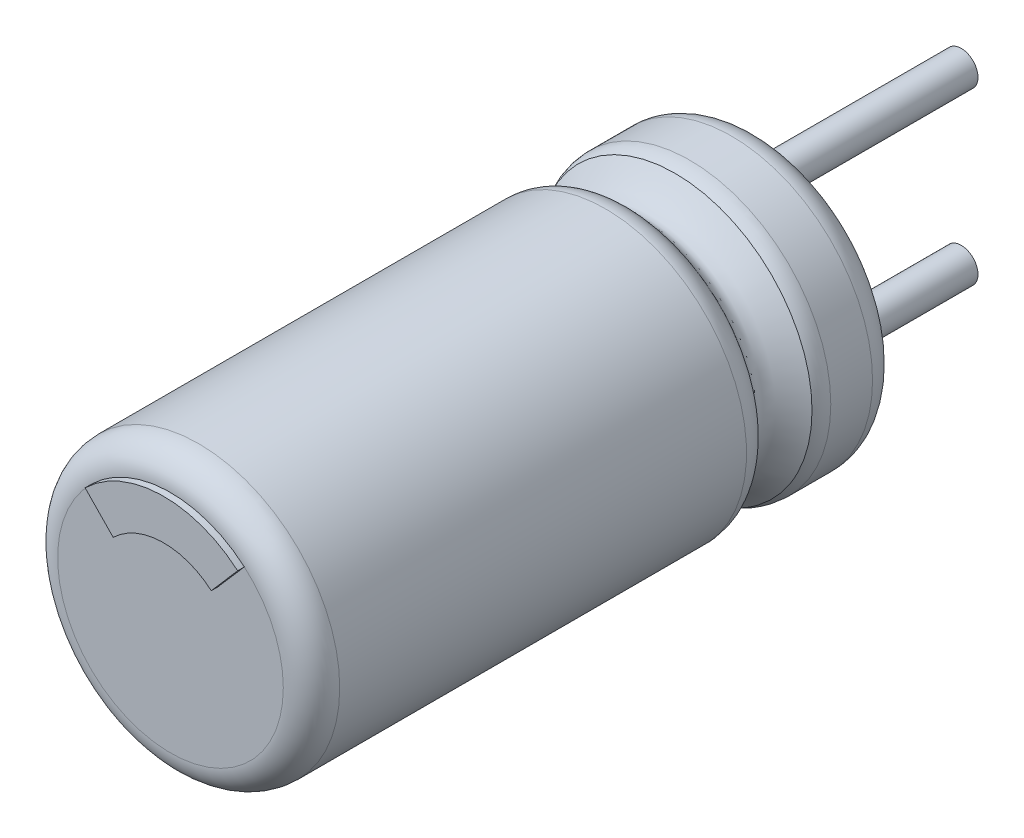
ISO-10303-21;
HEADER;
FILE_DESCRIPTION(('STEP AP214'),'2;1');
FILE_NAME('part.step','',(''),(''),'','','');
FILE_SCHEMA(('AUTOMOTIVE_DESIGN { 1 0 10303 214 1 1 1 1 }'));
ENDSEC;
DATA;
#1=APPLICATION_CONTEXT('core data for automotive mechanical design processes');
#2=APPLICATION_PROTOCOL_DEFINITION('international standard','automotive_design',2000,#1);
#3=PRODUCT_CONTEXT('',#1,'mechanical');
#4=PRODUCT('Part','Part','',(#3));
#5=PRODUCT_RELATED_PRODUCT_CATEGORY('part','',(#4));
#6=PRODUCT_DEFINITION_FORMATION('','',#4);
#7=PRODUCT_DEFINITION_CONTEXT('part definition',#1,'design');
#8=PRODUCT_DEFINITION('design','',#6,#7);
#9=PRODUCT_DEFINITION_SHAPE('','',#8);
#10=(LENGTH_UNIT() NAMED_UNIT(*) SI_UNIT(.MILLI.,.METRE.));
#11=(NAMED_UNIT(*) PLANE_ANGLE_UNIT() SI_UNIT($,.RADIAN.));
#12=(NAMED_UNIT(*) SI_UNIT($,.STERADIAN.) SOLID_ANGLE_UNIT());
#13=UNCERTAINTY_MEASURE_WITH_UNIT(LENGTH_MEASURE(1.E-05),#10,'distance_accuracy_value','');
#14=(GEOMETRIC_REPRESENTATION_CONTEXT(3) GLOBAL_UNCERTAINTY_ASSIGNED_CONTEXT((#13)) GLOBAL_UNIT_ASSIGNED_CONTEXT((#10,
#11,#12)) REPRESENTATION_CONTEXT('',''));
#15=CARTESIAN_POINT('',(0.,0.,0.));
#16=DIRECTION('',(0.,0.,1.));
#17=DIRECTION('',(1.,0.,0.));
#18=AXIS2_PLACEMENT_3D('',#15,#16,#17);
#19=CARTESIAN_POINT('',(0.,0.,0.));
#20=DIRECTION('',(0.,0.,1.));
#21=DIRECTION('',(1.,0.,0.));
#22=AXIS2_PLACEMENT_3D('',#19,#20,#21);
#23=PLANE('',#22);
#24=CARTESIAN_POINT('',(0.,1.27,0.));
#25=DIRECTION('',(0.,0.,1.));
#26=DIRECTION('',(1.,0.,0.));
#27=AXIS2_PLACEMENT_3D('',#24,#25,#26);
#28=CIRCLE('',#27,0.25);
#29=CARTESIAN_POINT('',(0.25,1.27,0.));
#30=VERTEX_POINT('',#29);
#31=EDGE_CURVE('E33',#30,#30,#28,.F.);
#32=ORIENTED_EDGE('',*,*,#31,.F.);
#33=EDGE_LOOP('',(#32));
#34=FACE_BOUND('',#33,.T.);
#35=CARTESIAN_POINT('',(0.,0.,0.));
#36=DIRECTION('',(0.,0.,1.));
#37=DIRECTION('',(1.,0.,0.));
#38=AXIS2_PLACEMENT_3D('',#35,#36,#37);
#39=CIRCLE('',#38,1.68);
#40=CARTESIAN_POINT('',(1.68,0.,0.));
#41=VERTEX_POINT('',#40);
#42=EDGE_CURVE('E106',#41,#41,#39,.F.);
#43=ORIENTED_EDGE('',*,*,#42,.T.);
#44=EDGE_LOOP('',(#43));
#45=FACE_BOUND('',#44,.T.);
#46=CARTESIAN_POINT('',(0.,-1.27,0.));
#47=DIRECTION('',(0.,0.,-1.));
#48=DIRECTION('',(-1.,0.,0.));
#49=AXIS2_PLACEMENT_3D('',#46,#47,#48);
#50=CIRCLE('',#49,0.25);
#51=CARTESIAN_POINT('',(-0.25,-1.27,0.));
#52=VERTEX_POINT('',#51);
#53=EDGE_CURVE('E11',#52,#52,#50,.T.);
#54=ORIENTED_EDGE('',*,*,#53,.F.);
#55=EDGE_LOOP('',(#54));
#56=FACE_BOUND('',#55,.T.);
#57=ADVANCED_FACE('F29',(#34,#45,#56),#23,.F.);
#58=CARTESIAN_POINT('',(0.,0.,1.26));
#59=DIRECTION('',(0.,0.,-1.));
#60=DIRECTION('',(-1.,0.,0.));
#61=AXIS2_PLACEMENT_3D('',#58,#59,#60);
#62=CYLINDRICAL_SURFACE('',#61,2.1);
#63=CARTESIAN_POINT('',(0.,0.,0.420000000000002));
#64=DIRECTION('',(0.,0.,1.));
#65=DIRECTION('',(1.,0.,0.));
#66=AXIS2_PLACEMENT_3D('',#63,#64,#65);
#67=CIRCLE('',#66,2.1);
#68=CARTESIAN_POINT('',(2.1,0.,0.420000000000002));
#69=VERTEX_POINT('',#68);
#70=EDGE_CURVE('E100',#69,#69,#67,.T.);
#71=ORIENTED_EDGE('',*,*,#70,.T.);
#72=EDGE_LOOP('',(#71));
#73=FACE_BOUND('',#72,.T.);
#74=CARTESIAN_POINT('',(0.,0.,1.04172901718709));
#75=DIRECTION('',(0.,0.,1.));
#76=DIRECTION('',(1.,0.,0.));
#77=AXIS2_PLACEMENT_3D('',#74,#75,#76);
#78=CIRCLE('',#77,2.1);
#79=CARTESIAN_POINT('',(2.1,0.,1.04172901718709));
#80=VERTEX_POINT('',#79);
#81=EDGE_CURVE('E98',#80,#80,#78,.F.);
#82=ORIENTED_EDGE('',*,*,#81,.T.);
#83=EDGE_LOOP('',(#82));
#84=FACE_BOUND('',#83,.T.);
#85=ADVANCED_FACE('F31',(#73,#84),#62,.T.);
#86=CARTESIAN_POINT('',(-1.50899360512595,1.4604582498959,1.21387283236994));
#87=CARTESIAN_POINT('',(-1.35553127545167,1.34036125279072,1.3595947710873));
#88=CARTESIAN_POINT('',(-1.01454808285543,1.07351363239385,1.68337932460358));
#89=CARTESIAN_POINT('',(-1.52634017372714,1.07033370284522,1.92241639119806));
#90=CARTESIAN_POINT('',(-1.80779596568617,1.068584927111,2.05387283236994));
#91=CARTESIAN_POINT('',(-4.42991010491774,-1.55752896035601,1.21387283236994));
#92=CARTESIAN_POINT('',(-4.03625378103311,-1.37070129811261,1.3595947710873));
#93=CARTESIAN_POINT('',(-3.16157534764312,-0.95558253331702,1.68337932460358));
#94=CARTESIAN_POINT('',(-3.66700757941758,-1.98234664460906,1.92241639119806));
#95=CARTESIAN_POINT('',(-3.94496581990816,-2.54700700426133,2.05387283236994));
#96=CARTESIAN_POINT('',(-1.41192289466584,-4.4784454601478,1.21387283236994));
#97=CARTESIAN_POINT('',(-1.32519123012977,-4.05142380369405,1.3595947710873));
#98=CARTESIAN_POINT('',(-1.13247918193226,-3.10260979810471,1.68337932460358));
#99=CARTESIAN_POINT('',(-0.614327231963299,-4.1230140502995,1.92241639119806));
#100=CARTESIAN_POINT('',(-0.32937388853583,-4.68417685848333,2.05387283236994));
#101=CARTESIAN_POINT('',(1.50899360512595,-1.4604582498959,1.21387283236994));
#102=CARTESIAN_POINT('',(1.35553127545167,-1.34036125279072,1.3595947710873));
#103=CARTESIAN_POINT('',(1.01454808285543,-1.07351363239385,1.68337932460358));
#104=CARTESIAN_POINT('',(1.52634017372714,-1.07033370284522,1.92241639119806));
#105=CARTESIAN_POINT('',(1.80779596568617,-1.068584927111,2.05387283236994));
#106=CARTESIAN_POINT('',(4.42991010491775,1.55752896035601,1.21387283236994));
#107=CARTESIAN_POINT('',(4.03625378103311,1.37070129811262,1.3595947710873));
#108=CARTESIAN_POINT('',(3.16157534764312,0.955582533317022,1.68337932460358));
#109=CARTESIAN_POINT('',(3.66700757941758,1.98234664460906,1.92241639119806));
#110=CARTESIAN_POINT('',(3.94496581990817,2.54700700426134,2.05387283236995));
#111=CARTESIAN_POINT('',(1.41192289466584,4.4784454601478,1.21387283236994));
#112=CARTESIAN_POINT('',(1.32519123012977,4.05142380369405,1.3595947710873));
#113=CARTESIAN_POINT('',(1.13247918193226,3.10260979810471,1.68337932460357));
#114=CARTESIAN_POINT('',(0.614327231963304,4.1230140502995,1.92241639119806));
#115=CARTESIAN_POINT('',(0.329373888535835,4.68417685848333,2.05387283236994));
#116=CARTESIAN_POINT('',(-1.50899360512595,1.4604582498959,1.21387283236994));
#117=CARTESIAN_POINT('',(-1.35553127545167,1.34036125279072,1.3595947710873));
#118=CARTESIAN_POINT('',(-1.01454808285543,1.07351363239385,1.68337932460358));
#119=CARTESIAN_POINT('',(-1.52634017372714,1.07033370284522,1.92241639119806));
#120=CARTESIAN_POINT('',(-1.80779596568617,1.068584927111,2.05387283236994));
#121=(BOUNDED_SURFACE() B_SPLINE_SURFACE(3,3,((#86,#87,#88,#89,#90),(#91,#92,#93,#94,#95),(#96,
#97,#98,#99,#100),(#101,#102,#103,#104,#105),(#106,#107,#108,#109,#110),(#111,#112,#113,#114,
#115),(#116,#117,#118,#119,#120)),.UNSPECIFIED.,.T.,.F.,.F.) B_SPLINE_SURFACE_WITH_KNOTS((4,3,
4),(4,1,4),(0.,0.5,1.),(0.,0.45005834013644,1.),
.UNSPECIFIED.) GEOMETRIC_REPRESENTATION_ITEM() RATIONAL_B_SPLINE_SURFACE(((1.,1.,1.,1.,1.),
(0.333333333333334,0.333333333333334,0.333333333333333,0.333333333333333,0.333333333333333),
(0.333333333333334,0.333333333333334,0.333333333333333,0.333333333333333,0.333333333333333),(1.,
1.,1.,1.,1.),(0.333333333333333,0.333333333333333,0.333333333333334,0.333333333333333,
0.333333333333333),(0.333333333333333,0.333333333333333,0.333333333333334,0.333333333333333,
0.333333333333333),(1.,1.,1.,1.,1.))) REPRESENTATION_ITEM('') SURFACE());
#122=CARTESIAN_POINT('',(0.,0.,1.94152539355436));
#123=DIRECTION('',(0.,0.,1.));
#124=DIRECTION('',(1.,0.,0.));
#125=AXIS2_PLACEMENT_3D('',#122,#123,#124);
#126=CIRCLE('',#125,1.90462380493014);
#127=CARTESIAN_POINT('',(-1.57437307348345,1.07188677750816,1.94152539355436));
#128=VERTEX_POINT('',#127);
#129=EDGE_CURVE('E74',#128,#128,#126,.F.);
#130=CARTESIAN_POINT('',(0.,0.,1.26));
#131=DIRECTION('',(0.,0.,1.));
#132=DIRECTION('',(1.,0.,0.));
#133=AXIS2_PLACEMENT_3D('',#130,#131,#132);
#134=CIRCLE('',#133,2.0388283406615);
#135=CARTESIAN_POINT('',(-1.4605981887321,1.42248864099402,1.26));
#136=VERTEX_POINT('',#135);
#137=EDGE_CURVE('E91',#136,#136,#134,.T.);
#138=CARTESIAN_POINT('',(-1.57437307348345,1.07188677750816,1.94152539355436));
#139=CARTESIAN_POINT('',(-1.57289940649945,1.07193285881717,1.94077078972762));
#140=CARTESIAN_POINT('',(-1.5714263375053,1.07197971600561,1.9400150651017));
#141=CARTESIAN_POINT('',(-1.56848497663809,1.07207491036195,1.93850313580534));
#142=CARTESIAN_POINT('',(-1.56701668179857,1.07212324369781,1.93774693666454));
#143=CARTESIAN_POINT('',(-1.56408496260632,1.07222141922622,1.9362340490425));
#144=CARTESIAN_POINT('',(-1.56262153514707,1.07227125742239,1.93547736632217));
#145=CARTESIAN_POINT('',(-1.55969964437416,1.07237247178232,1.93396350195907));
#146=CARTESIAN_POINT('',(-1.55824117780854,1.07242384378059,1.93320632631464));
#147=CARTESIAN_POINT('',(-1.5553293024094,1.07252815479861,1.93169146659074));
#148=CARTESIAN_POINT('',(-1.5538758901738,1.07258108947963,1.93093378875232));
#149=CARTESIAN_POINT('',(-1.55097421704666,1.07268855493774,1.92941791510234));
#150=CARTESIAN_POINT('',(-1.54952595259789,1.07274308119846,1.92865972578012));
#151=CARTESIAN_POINT('',(-1.54663466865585,1.07285375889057,1.92714281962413));
#152=CARTESIAN_POINT('',(-1.5451916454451,1.07290990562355,1.92638410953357));
#153=CARTESIAN_POINT('',(-1.5423109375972,1.07302385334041,1.92486615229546));
#154=CARTESIAN_POINT('',(-1.54087324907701,1.07308164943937,1.92410691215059));
#155=CARTESIAN_POINT('',(-1.53800330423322,1.07319892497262,1.92258788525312));
#156=CARTESIAN_POINT('',(-1.53657104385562,1.07325839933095,1.92182810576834));
#157=CARTESIAN_POINT('',(-1.53371204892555,1.07337906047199,1.92030799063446));
#158=CARTESIAN_POINT('',(-1.53228531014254,1.07344024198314,1.91954766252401));
#159=CARTESIAN_POINT('',(-1.52943745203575,1.0735643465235,1.9180264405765));
#160=CARTESIAN_POINT('',(-1.52801632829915,1.07362726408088,1.91726555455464));
#161=CARTESIAN_POINT('',(-1.52517979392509,1.07375486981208,1.91574320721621));
#162=CARTESIAN_POINT('',(-1.5237643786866,1.07381955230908,1.91498175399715));
#163=CARTESIAN_POINT('',(-1.5209393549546,1.07395071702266,1.91345826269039));
#164=CARTESIAN_POINT('',(-1.51952974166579,1.07401719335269,1.91269623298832));
#165=CARTESIAN_POINT('',(-1.51671641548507,1.07415197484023,1.91117157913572));
#166=CARTESIAN_POINT('',(-1.51531269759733,1.07422027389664,1.91040896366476));
#167=CARTESIAN_POINT('',(-1.51251125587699,1.07435872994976,1.90888312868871));
#168=CARTESIAN_POINT('',(-1.51111352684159,1.07442888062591,1.90811991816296));
#169=CARTESIAN_POINT('',(-1.50832415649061,1.07457106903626,1.90659288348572));
#170=CARTESIAN_POINT('',(-1.50693250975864,1.07464310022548,1.90582906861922));
#171=CARTESIAN_POINT('',(-1.50415539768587,1.07478907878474,1.90430081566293));
#172=CARTESIAN_POINT('',(-1.50276992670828,1.07486301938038,1.90353638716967));
#173=CARTESIAN_POINT('',(-1.50000525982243,1.07501284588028,1.90200689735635));
#174=CARTESIAN_POINT('',(-1.49862605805,1.07508872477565,1.90124184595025));
#175=CARTESIAN_POINT('',(-1.49587402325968,1.07524245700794,1.89971110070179));
#176=CARTESIAN_POINT('',(-1.494501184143,1.07532030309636,1.89894541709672));
#177=CARTESIAN_POINT('',(-1.49176196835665,1.07547799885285,1.89741339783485));
#178=CARTESIAN_POINT('',(-1.49039558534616,1.07555784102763,1.89664707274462));
#179=CARTESIAN_POINT('',(-1.48766937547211,1.07571955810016,1.89511376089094));
#180=CARTESIAN_POINT('',(-1.48630954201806,1.07580142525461,1.89434678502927));
#181=CARTESIAN_POINT('',(-1.48359652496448,1.0759672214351,1.89281216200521));
#182=CARTESIAN_POINT('',(-1.48224333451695,1.07605114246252,1.89204452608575));
#183=CARTESIAN_POINT('',(-1.47954369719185,1.0762210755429,1.89050857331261));
#184=CARTESIAN_POINT('',(-1.47819724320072,1.07630707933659,1.88974026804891));
#185=CARTESIAN_POINT('',(-1.47551117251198,1.07648120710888,1.8882029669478));
#186=CARTESIAN_POINT('',(-1.47417154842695,1.07656932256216,1.88743398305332));
#187=CARTESIAN_POINT('',(-1.4714992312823,1.07674770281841,1.88589531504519));
#188=CARTESIAN_POINT('',(-1.47016653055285,1.07683795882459,1.88512564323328));
#189=CARTESIAN_POINT('',(-1.46750815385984,1.07702064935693,1.8835855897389));
#190=CARTESIAN_POINT('',(-1.46618246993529,1.07711307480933,1.88281522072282));
#191=CARTESIAN_POINT('',(-1.46353822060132,1.07730013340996,1.88127376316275));
#192=CARTESIAN_POINT('',(-1.46221964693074,1.07739475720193,1.88050268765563));
#193=CARTESIAN_POINT('',(-1.45958971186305,1.07758624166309,1.87895980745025));
#194=CARTESIAN_POINT('',(-1.45827834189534,1.07768309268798,1.8781880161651));
#195=CARTESIAN_POINT('',(-1.45566290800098,1.07787906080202,1.87664369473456));
#196=CARTESIAN_POINT('',(-1.4543588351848,1.07797816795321,1.87587117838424));
#197=CARTESIAN_POINT('',(-1.45175808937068,1.07817867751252,1.87432539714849));
#198=CARTESIAN_POINT('',(-1.45046140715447,1.07828006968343,1.87355214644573));
#199=CARTESIAN_POINT('',(-1.4478755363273,1.07848517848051,1.8720048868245));
#200=CARTESIAN_POINT('',(-1.44658633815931,1.07858888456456,1.87123089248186));
#201=CARTESIAN_POINT('',(-1.44401552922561,1.07879865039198,1.86968213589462));
#202=CARTESIAN_POINT('',(-1.44273390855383,1.07890469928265,1.8689073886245));
#203=CARTESIAN_POINT('',(-1.44017834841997,1.07911917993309,1.86735711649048));
#204=CARTESIAN_POINT('',(-1.43890439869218,1.07922760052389,1.8665816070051));
#205=CARTESIAN_POINT('',(-1.43636427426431,1.07944685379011,1.86502980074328));
#206=CARTESIAN_POINT('',(-1.43509808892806,1.07955767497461,1.86425351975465));
#207=CARTESIAN_POINT('',(-1.43257358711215,1.07978175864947,1.86270016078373));
#208=CARTESIAN_POINT('',(-1.43131525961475,1.07989500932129,1.86192309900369));
#209=CARTESIAN_POINT('',(-1.42880656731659,1.08012398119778,1.86036816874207));
#210=CARTESIAN_POINT('',(-1.42755619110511,1.0802396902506,1.85959031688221));
#211=CARTESIAN_POINT('',(-1.42506349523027,1.08047360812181,1.85803379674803));
#212=CARTESIAN_POINT('',(-1.42382116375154,1.08059180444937,1.85725514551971));
#213=CARTESIAN_POINT('',(-1.4213446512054,1.08083072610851,1.85569701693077));
#214=CARTESIAN_POINT('',(-1.42011045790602,1.08095143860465,1.85491755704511));
#215=CARTESIAN_POINT('',(-1.41765031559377,1.08119542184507,1.8533578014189));
#216=CARTESIAN_POINT('',(-1.41642435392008,1.0813186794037,1.85257752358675));
#217=CARTESIAN_POINT('',(-1.41398076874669,1.08156778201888,1.85101612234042));
#218=CARTESIAN_POINT('',(-1.4127631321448,1.08169361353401,1.85023501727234));
#219=CARTESIAN_POINT('',(-1.41033629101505,1.08194789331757,1.84867195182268));
#220=CARTESIAN_POINT('',(-1.40912707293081,1.08207632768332,1.84789001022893));
#221=CARTESIAN_POINT('',(-1.40671716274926,1.08233584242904,1.84632526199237));
#222=CARTESIAN_POINT('',(-1.40551645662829,1.08246690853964,1.8455424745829));
#223=CARTESIAN_POINT('',(-1.40312366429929,1.08273171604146,1.84397602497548));
#224=CARTESIAN_POINT('',(-1.40193156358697,1.08286544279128,1.84319238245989));
#225=CARTESIAN_POINT('',(-1.39955607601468,1.0831356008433,1.84162421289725));
#226=CARTESIAN_POINT('',(-1.39837267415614,1.08327201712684,1.84083970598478));
#227=CARTESIAN_POINT('',(-1.39601467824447,1.08354758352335,1.83926979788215));
#228=CARTESIAN_POINT('',(-1.39484006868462,1.08368671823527,1.83848441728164));
#229=CARTESIAN_POINT('',(-1.39249975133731,1.08396775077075,1.83691275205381));
#230=CARTESIAN_POINT('',(-1.3913340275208,1.08410963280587,1.83612648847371));
#231=CARTESIAN_POINT('',(-1.38901157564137,1.084396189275,1.834553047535));
#232=CARTESIAN_POINT('',(-1.38785483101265,1.08454084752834,1.83376589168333));
#233=CARTESIAN_POINT('',(-1.3855504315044,1.084832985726,1.83219065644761));
#234=CARTESIAN_POINT('',(-1.38440275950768,1.08498044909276,1.83140259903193));
#235=CARTESIAN_POINT('',(-1.38211659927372,1.08527822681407,1.82982555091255));
#236=CARTESIAN_POINT('',(-1.38097809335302,1.08542852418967,1.82903658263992));
#237=CARTESIAN_POINT('',(-1.37871035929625,1.08573199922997,1.82745770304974));
#238=CARTESIAN_POINT('',(-1.37758111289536,1.08588515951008,1.82666781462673));
#239=CARTESIAN_POINT('',(-1.37533199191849,1.08619438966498,1.82508708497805));
#240=CARTESIAN_POINT('',(-1.37421209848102,1.08635044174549,1.82429626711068));
#241=CARTESIAN_POINT('',(-1.37198177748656,1.08666548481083,1.82271366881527));
#242=CARTESIAN_POINT('',(-1.37087133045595,1.08682445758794,1.82192191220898));
#243=CARTESIAN_POINT('',(-1.36865999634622,1.08714537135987,1.82033742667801));
#244=CARTESIAN_POINT('',(-1.36755908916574,1.08730729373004,1.81954472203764));
#245=CARTESIAN_POINT('',(-1.3653669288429,1.08763413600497,1.81795833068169));
#246=CARTESIAN_POINT('',(-1.36427565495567,1.087799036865,1.81716466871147));
#247=CARTESIAN_POINT('',(-1.36210285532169,1.08813186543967,1.81557635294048));
#248=CARTESIAN_POINT('',(-1.36102130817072,1.08829977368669,1.81478172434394));
#249=CARTESIAN_POINT('',(-1.35886805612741,1.08863864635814,1.81319146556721));
#250=CARTESIAN_POINT('',(-1.35779632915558,1.08880959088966,1.81239586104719));
#251=CARTESIAN_POINT('',(-1.35566281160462,1.08915456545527,1.81080364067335));
#252=CARTESIAN_POINT('',(-1.35460099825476,1.08932857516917,1.81000705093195));
#253=CARTESIAN_POINT('',(-1.35248740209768,1.0896797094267,1.80841285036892));
#254=CARTESIAN_POINT('',(-1.35143559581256,1.08985681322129,1.80761526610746));
#255=CARTESIAN_POINT('',(-1.34934210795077,1.09021416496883,1.80601906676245));
#256=CARTESIAN_POINT('',(-1.34830040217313,1.09039439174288,1.80522047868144));
#257=CARTESIAN_POINT('',(-1.34622720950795,1.09075801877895,1.8036222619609));
#258=CARTESIAN_POINT('',(-1.34519569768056,1.09094139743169,1.80282266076));
#259=CARTESIAN_POINT('',(-1.34314298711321,1.0913113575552,1.8012224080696));
#260=CARTESIAN_POINT('',(-1.34212176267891,1.09149791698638,1.80042178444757));
#261=CARTESIAN_POINT('',(-1.34008972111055,1.09187426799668,1.7988194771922));
#262=CARTESIAN_POINT('',(-1.33907887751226,1.09206403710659,1.79801782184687));
#263=CARTESIAN_POINT('',(-1.33706769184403,1.09244683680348,1.79641344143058));
#264=CARTESIAN_POINT('',(-1.33606732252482,1.09263984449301,1.7956107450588));
#265=CARTESIAN_POINT('',(-1.33407717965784,1.09302915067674,1.79400427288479));
#266=CARTESIAN_POINT('',(-1.33308737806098,1.09322542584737,1.7932005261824));
#267=CARTESIAN_POINT('',(-1.3311184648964,1.09362129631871,1.791591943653));
#268=CARTESIAN_POINT('',(-1.33013932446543,1.0938208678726,1.79078713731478));
#269=CARTESIAN_POINT('',(-1.32819182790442,1.09422336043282,1.78917642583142));
#270=CARTESIAN_POINT('',(-1.3272234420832,1.0944262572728,1.78837055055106));
#271=CARTESIAN_POINT('',(-1.32529754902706,1.09483542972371,1.78675769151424));
#272=CARTESIAN_POINT('',(-1.32434001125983,1.09504168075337,1.78595073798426));
#273=CARTESIAN_POINT('',(-1.32243590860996,1.09545759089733,1.78433571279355));
#274=CARTESIAN_POINT('',(-1.32148931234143,1.09566722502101,1.78352767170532));
#275=CARTESIAN_POINT('',(-1.31960718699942,1.09608993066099,1.78191046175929));
#276=CARTESIAN_POINT('',(-1.31867162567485,1.09630297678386,1.78110132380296));
#277=CARTESIAN_POINT('',(-1.3168116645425,1.09673253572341,1.77948191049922));
#278=CARTESIAN_POINT('',(-1.31588723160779,1.0969490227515,1.77867166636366));
#279=CARTESIAN_POINT('',(-1.31404962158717,1.09738549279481,1.77705003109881));
#280=CARTESIAN_POINT('',(-1.31313641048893,1.09760544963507,1.77623867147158));
#281=CARTESIAN_POINT('',(-1.31132133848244,1.09804888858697,1.7746147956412));
#282=CARTESIAN_POINT('',(-1.31041944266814,1.09827234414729,1.77380231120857));
#283=CARTESIAN_POINT('',(-1.30862709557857,1.0987228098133,1.7721761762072));
#284=CARTESIAN_POINT('',(-1.3077366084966,1.09894979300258,1.77136255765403));
#285=CARTESIAN_POINT('',(-1.3059671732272,1.0994073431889,1.76973414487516));
#286=CARTESIAN_POINT('',(-1.30508818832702,1.09963788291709,1.76891938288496));
#287=CARTESIAN_POINT('',(-1.30334185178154,1.10010257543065,1.76728867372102));
#288=CARTESIAN_POINT('',(-1.3024744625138,1.10033670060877,1.76647275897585));
#289=CARTESIAN_POINT('',(-1.30075141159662,1.10080859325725,1.76483973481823));
#290=CARTESIAN_POINT('',(-1.29989571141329,1.10104633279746,1.76402265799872));
#291=CARTESIAN_POINT('',(-1.29819613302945,1.1015254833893,1.76238730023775));
#292=CARTESIAN_POINT('',(-1.29735221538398,1.10176686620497,1.76156905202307));
#293=CARTESIAN_POINT('',(-1.29567629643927,1.10225333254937,1.75993134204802));
#294=CARTESIAN_POINT('',(-1.29484425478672,1.10249838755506,1.75911191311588));
#295=CARTESIAN_POINT('',(-1.29319218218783,1.10299222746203,1.75747183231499));
#296=CARTESIAN_POINT('',(-1.29237210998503,1.10324098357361,1.75665121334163));
#297=CARTESIAN_POINT('',(-1.29074407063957,1.10374225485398,1.75500874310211));
#298=CARTESIAN_POINT('',(-1.28993606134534,1.10399474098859,1.75418692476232));
#299=CARTESIAN_POINT('',(-1.288332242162,1.10450350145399,1.75254204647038));
#300=CARTESIAN_POINT('',(-1.28753638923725,1.10475974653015,1.75171901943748));
#301=CARTESIAN_POINT('',(-1.28595697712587,1.10527605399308,1.75007171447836));
#302=CARTESIAN_POINT('',(-1.28517337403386,1.10553608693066,1.74924746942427));
#303=CARTESIAN_POINT('',(-1.28361855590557,1.10605999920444,1.74759771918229));
#304=CARTESIAN_POINT('',(-1.28284729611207,1.10632384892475,1.74677224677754));
#305=CARTESIAN_POINT('',(-1.2813172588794,1.10685542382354,1.74512003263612));
#306=CARTESIAN_POINT('',(-1.2805584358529,1.10712311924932,1.74429332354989));
#307=CARTESIAN_POINT('',(-1.2790533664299,1.10766241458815,1.74263862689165));
#308=CARTESIAN_POINT('',(-1.27830707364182,1.10793398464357,1.74181067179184));
#309=CARTESIAN_POINT('',(-1.27682715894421,1.10848105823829,1.74015347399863));
#310=CARTESIAN_POINT('',(-1.27609348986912,1.10875653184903,1.73932426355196));
#311=CARTESIAN_POINT('',(-1.27463891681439,1.10931144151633,1.73766454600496));
#312=CARTESIAN_POINT('',(-1.27391796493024,1.10959084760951,1.73683407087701));
#313=CARTESIAN_POINT('',(-1.27248892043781,1.11015365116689,1.73517181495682));
#314=CARTESIAN_POINT('',(-1.27178077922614,1.11043701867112,1.73434006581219));
#315=CARTESIAN_POINT('',(-1.27037745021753,1.11100777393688,1.73267525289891));
#316=CARTESIAN_POINT('',(-1.26968221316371,1.11129513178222,1.73184222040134));
#317=CARTESIAN_POINT('',(-1.26830478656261,1.11187389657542,1.73017483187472));
#318=CARTESIAN_POINT('',(-1.26762254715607,1.11216527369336,1.72934050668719));
#319=CARTESIAN_POINT('',(-1.26627120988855,1.11275210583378,1.72767052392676));
#320=CARTESIAN_POINT('',(-1.26560206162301,1.11304753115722,1.72683489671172));
#321=CARTESIAN_POINT('',(-1.26427700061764,1.11364248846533,1.72516230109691));
#322=CARTESIAN_POINT('',(-1.26362103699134,1.11394199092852,1.72432536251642));
#323=CARTESIAN_POINT('',(-1.26232243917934,1.11454513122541,1.72265013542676));
#324=CARTESIAN_POINT('',(-1.26167975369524,1.11484873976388,1.72181187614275));
#325=CARTESIAN_POINT('',(-1.26040780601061,1.11546012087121,1.72013399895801));
#326=CARTESIAN_POINT('',(-1.25977849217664,1.1157678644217,1.71929440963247));
#327=CARTESIAN_POINT('',(-1.25853338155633,1.11638754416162,1.71761386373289));
#328=CARTESIAN_POINT('',(-1.25791753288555,1.116699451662,1.71677293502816));
#329=CARTESIAN_POINT('',(-1.25669944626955,1.11732748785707,1.71508970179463));
#330=CARTESIAN_POINT('',(-1.25609715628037,1.1176435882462,1.71424742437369));
#331=CARTESIAN_POINT('',(-1.25490628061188,1.11828003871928,1.712561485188));
#332=CARTESIAN_POINT('',(-1.25431764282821,1.11860036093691,1.71171784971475));
#333=CARTESIAN_POINT('',(-1.25315416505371,1.11924528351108,1.71002918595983));
#334=CARTESIAN_POINT('',(-1.25257927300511,1.11956985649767,1.70918418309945));
#335=CARTESIAN_POINT('',(-1.25144338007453,1.12022330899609,1.70749277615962));
#336=CARTESIAN_POINT('',(-1.25088232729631,1.12055216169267,1.70664639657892));
#337=CARTESIAN_POINT('',(-1.24977420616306,1.12121420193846,1.7049522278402));
#338=CARTESIAN_POINT('',(-1.24922708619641,1.12154736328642,1.70410446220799));
#339=CARTESIAN_POINT('',(-1.24814692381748,1.1222180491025,1.70240751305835));
#340=CARTESIAN_POINT('',(-1.24761383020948,1.12255554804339,1.70155835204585));
#341=CARTESIAN_POINT('',(-1.24656181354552,1.12323493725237,1.69985860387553));
#342=CARTESIAN_POINT('',(-1.24604283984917,1.12357680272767,1.6990080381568));
#343=CARTESIAN_POINT('',(-1.24501915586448,1.12426495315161,1.69730547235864));
#344=CARTESIAN_POINT('',(-1.24451439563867,1.12461121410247,1.69645349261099));
#345=CARTESIAN_POINT('',(-1.24351923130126,1.12530818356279,1.69474809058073));
#346=CARTESIAN_POINT('',(-1.24302877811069,1.12565886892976,1.69389468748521));
#347=CARTESIAN_POINT('',(-1.24206232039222,1.12636471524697,1.69218643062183));
#348=CARTESIAN_POINT('',(-1.24158626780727,1.12671985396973,1.69133159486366));
#349=CARTESIAN_POINT('',(-1.24064870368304,1.12743463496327,1.68962046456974));
#350=CARTESIAN_POINT('',(-1.24018714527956,1.1277942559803,1.68876418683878));
#351=CARTESIAN_POINT('',(-1.23927866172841,1.12851802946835,1.6870501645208));
#352=CARTESIAN_POINT('',(-1.2388316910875,1.1288821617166,1.68619243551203));
#353=CARTESIAN_POINT('',(-1.23795247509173,1.12961498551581,1.68447550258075));
#354=CARTESIAN_POINT('',(-1.23752018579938,1.12998365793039,1.6836163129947));
#355=CARTESIAN_POINT('',(-1.23667042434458,1.13072558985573,1.68189645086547));
#356=CARTESIAN_POINT('',(-1.23625290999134,1.13109883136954,1.68103579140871));
#357=CARTESIAN_POINT('',(-1.23543279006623,1.13184992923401,1.6793129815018));
#358=CARTESIAN_POINT('',(-1.23503014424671,1.13222776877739,1.67845084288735));
#359=CARTESIAN_POINT('',(-1.23423985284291,1.13298809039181,1.67672506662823));
#360=CARTESIAN_POINT('',(-1.23385216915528,1.1333705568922,1.67586143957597));
#361=CARTESIAN_POINT('',(-1.23309189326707,1.13414016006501,1.67413267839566));
#362=CARTESIAN_POINT('',(-1.23271926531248,1.13452728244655,1.67326755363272));
#363=CARTESIAN_POINT('',(-1.23198919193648,1.13530622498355,1.67153578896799));
#364=CARTESIAN_POINT('',(-1.23163171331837,1.13569803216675,1.67066915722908));
#365=CARTESIAN_POINT('',(-1.23093202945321,1.13648637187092,1.66893437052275));
#366=CARTESIAN_POINT('',(-1.23058979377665,1.13688289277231,1.66806622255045));
#367=CARTESIAN_POINT('',(-1.22992068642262,1.13768068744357,1.66632839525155));
#368=CARTESIAN_POINT('',(-1.22959378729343,1.13808195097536,1.66545872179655));
#369=CARTESIAN_POINT('',(-1.22895544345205,1.13888925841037,1.66371783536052));
#370=CARTESIAN_POINT('',(-1.22864397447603,1.13929529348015,1.66284662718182));
#371=CARTESIAN_POINT('',(-1.22803658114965,1.14011217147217,1.66110266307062));
#372=CARTESIAN_POINT('',(-1.2277406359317,1.14052300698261,1.66022991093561));
#373=CARTESIAN_POINT('',(-1.22716438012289,1.14134951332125,1.6584828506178));
#374=CARTESIAN_POINT('',(-1.22688405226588,1.14176517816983,1.65760854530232));
#375=CARTESIAN_POINT('',(-1.22633912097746,1.14260137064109,1.6558583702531));
#376=CARTESIAN_POINT('',(-1.22607450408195,1.14302189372,1.65498250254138));
#377=CARTESIAN_POINT('',(-1.22556108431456,1.14386783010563,1.6532291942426));
#378=CARTESIAN_POINT('',(-1.22531227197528,1.14429324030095,1.65235175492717));
#379=CARTESIAN_POINT('',(-1.22483055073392,1.14514897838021,1.6505952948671));
#380=CARTESIAN_POINT('',(-1.22459763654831,1.14557930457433,1.64971627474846));
#381=CARTESIAN_POINT('',(-1.22414780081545,1.14644490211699,1.64795664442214));
#382=CARTESIAN_POINT('',(-1.22393087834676,1.14688017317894,1.64707603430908));
#383=CARTESIAN_POINT('',(-1.22351311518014,1.14775568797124,1.64531321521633));
#384=CARTESIAN_POINT('',(-1.22331227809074,1.14819593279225,1.64443100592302));
#385=CARTESIAN_POINT('',(-1.22292677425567,1.14908142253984,1.64266497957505));
#386=CARTESIAN_POINT('',(-1.22274211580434,1.14952666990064,1.64178116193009));
#387=CARTESIAN_POINT('',(-1.22238905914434,1.15042219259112,1.64001190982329));
#388=CARTESIAN_POINT('',(-1.22222067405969,1.1508724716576,1.63912647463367));
#389=CARTESIAN_POINT('',(-1.22190024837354,1.15177808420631,1.63735397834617));
#390=CARTESIAN_POINT('',(-1.22174822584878,1.15223342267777,1.63646691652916));
#391=CARTESIAN_POINT('',(-1.22146063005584,1.15314918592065,1.63469115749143));
#392=CARTESIAN_POINT('',(-1.22132507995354,1.15360961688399,1.63380245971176));
#393=CARTESIAN_POINT('',(-1.22107044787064,1.15453556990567,1.63202342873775));
#394=CARTESIAN_POINT('',(-1.22095139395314,1.15500109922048,1.63113309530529));
#395=CARTESIAN_POINT('',(-1.2207296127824,1.15593720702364,1.62935080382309));
#396=CARTESIAN_POINT('',(-1.2206269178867,1.15640779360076,1.62845884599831));
#397=CARTESIAN_POINT('',(-1.22043774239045,1.15735398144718,1.62667331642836));
#398=CARTESIAN_POINT('',(-1.220351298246,1.15782959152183,1.62577974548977));
#399=CARTESIAN_POINT('',(-1.22019450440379,1.15878578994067,1.62399100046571));
#400=CARTESIAN_POINT('',(-1.22012419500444,1.15926638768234,1.62309582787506));
#401=CARTESIAN_POINT('',(-1.21999955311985,1.16023252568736,1.62130389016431));
#402=CARTESIAN_POINT('',(-1.21994526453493,1.16071807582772,1.62040712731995));
#403=CARTESIAN_POINT('',(-1.21985254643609,1.16169408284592,1.61861201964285));
#404=CARTESIAN_POINT('',(-1.21981416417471,1.16218454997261,1.61771367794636));
#405=CARTESIAN_POINT('',(-1.21975314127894,1.16317035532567,1.61591542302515));
#406=CARTESIAN_POINT('',(-1.21973055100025,1.16366570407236,1.61501551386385));
#407=CARTESIAN_POINT('',(-1.21970099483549,1.16466123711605,1.61321413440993));
#408=CARTESIAN_POINT('',(-1.21969408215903,1.1651614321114,1.61231266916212));
#409=CARTESIAN_POINT('',(-1.21969576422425,1.16616662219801,1.61050818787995));
#410=CARTESIAN_POINT('',(-1.2197044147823,1.16667162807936,1.60960517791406));
#411=CARTESIAN_POINT('',(-1.21973710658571,1.16768640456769,1.60779761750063));
#412=CARTESIAN_POINT('',(-1.21976120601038,1.16819618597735,1.6068930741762));
#413=CARTESIAN_POINT('',(-1.21982467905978,1.16922047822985,1.60508245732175));
#414=CARTESIAN_POINT('',(-1.21986411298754,1.16973499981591,1.60417639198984));
#415=CARTESIAN_POINT('',(-1.21995813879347,1.17076873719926,1.60236274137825));
#416=CARTESIAN_POINT('',(-1.22001279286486,1.17128796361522,1.60145516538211));
#417=CARTESIAN_POINT('',(-1.22013714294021,1.17233107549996,1.59963850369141));
#418=CARTESIAN_POINT('',(-1.22020690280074,1.17285497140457,1.5987294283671));
#419=CARTESIAN_POINT('',(-1.22036134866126,1.17390738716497,1.59690977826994));
#420=CARTESIAN_POINT('',(-1.22044609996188,1.17443591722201,1.59599921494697));
#421=CARTESIAN_POINT('',(-1.22063041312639,1.17549756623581,1.59417659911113));
#422=CARTESIAN_POINT('',(-1.22073004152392,1.17603069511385,1.59326455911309));
#423=CARTESIAN_POINT('',(-1.22094399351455,1.17710150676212,1.59143900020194));
#424=CARTESIAN_POINT('',(-1.22105838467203,1.17763919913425,1.59052549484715));
#425=CARTESIAN_POINT('',(-1.22130174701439,1.17871910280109,1.58869701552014));
#426=CARTESIAN_POINT('',(-1.22143078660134,1.17926132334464,1.58778205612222));
#427=CARTESIAN_POINT('',(-1.22170333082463,1.18035024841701,1.58595067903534));
#428=CARTESIAN_POINT('',(-1.22184690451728,1.18089696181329,1.58503427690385));
#429=CARTESIAN_POINT('',(-1.22214840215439,1.18199483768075,1.58320002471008));
#430=CARTESIAN_POINT('',(-1.22230639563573,1.18254600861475,1.58228219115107));
#431=CARTESIAN_POINT('',(-1.2226366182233,1.18365276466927,1.58044508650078));
#432=CARTESIAN_POINT('',(-1.2228089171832,1.18420835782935,1.57952583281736));
#433=CARTESIAN_POINT('',(-1.22316763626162,1.18532392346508,1.57768589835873));
#434=CARTESIAN_POINT('',(-1.22335412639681,1.18588390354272,1.57676523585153));
#435=CARTESIAN_POINT('',(-1.22374111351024,1.18700820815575,1.57492249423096));
#436=CARTESIAN_POINT('',(-1.22394168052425,1.18757253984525,1.57400043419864));
#437=CARTESIAN_POINT('',(-1.22435670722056,1.18870551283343,1.57215490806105));
#438=CARTESIAN_POINT('',(-1.22457123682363,1.18927416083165,1.57123146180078));
#439=CARTESIAN_POINT('',(-1.22501407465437,1.1904157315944,1.56938317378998));
#440=CARTESIAN_POINT('',(-1.22524245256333,1.19098866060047,1.56845835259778));
#441=CARTESIAN_POINT('',(-1.22571287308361,1.19213875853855,1.56660732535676));
#442=CARTESIAN_POINT('',(-1.2259549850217,1.19271593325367,1.56568114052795));
#443=CARTESIAN_POINT('',(-1.22645275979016,1.19387448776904,1.56382739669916));
#444=CARTESIAN_POINT('',(-1.22670849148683,1.19445587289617,1.56289985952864));
#445=CARTESIAN_POINT('',(-1.22723339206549,1.1956228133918,1.56104342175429));
#446=CARTESIAN_POINT('',(-1.22750262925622,1.1962083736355,1.56011454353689));
#447=CARTESIAN_POINT('',(-1.22805442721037,1.19738362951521,1.5582554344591));
#448=CARTESIAN_POINT('',(-1.2283370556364,1.19797332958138,1.55732522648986));
#449=CARTESIAN_POINT('',(-1.22891552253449,1.19915683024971,1.55546346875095));
#450=CARTESIAN_POINT('',(-1.2292114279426,1.19975063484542,1.55453194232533));
#451=CARTESIAN_POINT('',(-1.22981633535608,1.20094230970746,1.55266755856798));
#452=CARTESIAN_POINT('',(-1.23012540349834,1.20154018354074,1.55173472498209));
#453=CARTESIAN_POINT('',(-1.23075652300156,1.20273996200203,1.54986773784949));
#454=CARTESIAN_POINT('',(-1.23107863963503,1.20334186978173,1.54893360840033));
#455=CARTESIAN_POINT('',(-1.23173574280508,1.20454968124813,1.54706404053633));
#456=CARTESIAN_POINT('',(-1.23207079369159,1.20515558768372,1.54612862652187));
#457=CARTESIAN_POINT('',(-1.23275365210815,1.20637136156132,1.54425650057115));
#458=CARTESIAN_POINT('',(-1.23310152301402,1.20698123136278,1.54331981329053));
#459=CARTESIAN_POINT('',(-1.23380990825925,1.20820489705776,1.54144515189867));
#460=CARTESIAN_POINT('',(-1.23417048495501,1.20881869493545,1.54050720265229));
#461=CARTESIAN_POINT('',(-1.23490416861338,1.21005018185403,1.53863002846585));
#462=CARTESIAN_POINT('',(-1.23527733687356,1.21066787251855,1.53769082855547));
#463=CARTESIAN_POINT('',(-1.23603609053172,1.21190711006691,1.53581116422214));
#464=CARTESIAN_POINT('',(-1.23642173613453,1.21252865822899,1.53487072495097));
#465=CARTESIAN_POINT('',(-1.2372053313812,1.21377557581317,1.53298859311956));
#466=CARTESIAN_POINT('',(-1.23760334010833,1.2144009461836,1.53204692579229));
#467=CARTESIAN_POINT('',(-1.23841154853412,1.21565547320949,1.53016234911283));
#468=CARTESIAN_POINT('',(-1.2388218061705,1.21628463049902,1.52921946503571));
#469=CARTESIAN_POINT('',(-1.23965439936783,1.21754669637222,1.52733246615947));
#470=CARTESIAN_POINT('',(-1.24007679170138,1.21817960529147,1.52638837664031));
#471=CARTESIAN_POINT('',(-1.24093354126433,1.21944913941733,1.52449897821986));
#472=CARTESIAN_POINT('',(-1.24136795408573,1.22008576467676,1.52355369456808));
#473=CARTESIAN_POINT('',(-1.24224863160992,1.22136269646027,1.52166191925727));
#474=CARTESIAN_POINT('',(-1.24269495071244,1.22200300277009,1.52071545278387));
#475=CARTESIAN_POINT('',(-1.24359932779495,1.22328726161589,1.51882132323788));
#476=CARTESIAN_POINT('',(-1.24405743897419,1.22393121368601,1.51787368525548));
#477=CARTESIAN_POINT('',(-1.24498528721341,1.22522272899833,1.51597722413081));
#478=CARTESIAN_POINT('',(-1.24545507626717,1.22587029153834,1.51502842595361));
#479=CARTESIAN_POINT('',(-1.24640616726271,1.22716899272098,1.51312965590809));
#480=CARTESIAN_POINT('',(-1.24688751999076,1.22782013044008,1.51217970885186));
#481=CARTESIAN_POINT('',(-1.24786162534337,1.22912594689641,1.51027865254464));
#482=CARTESIAN_POINT('',(-1.24835442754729,1.22978062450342,1.50932756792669));
#483=CARTESIAN_POINT('',(-1.24935131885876,1.23109348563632,1.50742424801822));
#484=CARTESIAN_POINT('',(-1.24985545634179,1.23175166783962,1.5064720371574));
#485=CARTESIAN_POINT('',(-1.25087490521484,1.2330715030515,1.50456647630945));
#486=CARTESIAN_POINT('',(-1.25139026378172,1.23373315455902,1.50361315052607));
#487=CARTESIAN_POINT('',(-1.25243204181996,1.23505989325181,1.50170537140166));
#488=CARTESIAN_POINT('',(-1.25295850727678,1.23572497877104,1.5007509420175));
#489=CARTESIAN_POINT('',(-1.25402238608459,1.23705855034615,1.49884096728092));
#490=CARTESIAN_POINT('',(-1.25455984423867,1.23772703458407,1.49788544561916));
#491=CARTESIAN_POINT('',(-1.25564559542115,1.23906736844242,1.49597329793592));
#492=CARTESIAN_POINT('',(-1.25619393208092,1.23973921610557,1.49501669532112));
#493=CARTESIAN_POINT('',(-1.25730132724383,1.24108624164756,1.49310239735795));
#494=CARTESIAN_POINT('',(-1.25786042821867,1.24176141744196,1.49214472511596));
#495=CARTESIAN_POINT('',(-1.25898923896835,1.2431150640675,1.49022829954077));
#496=CARTESIAN_POINT('',(-1.25955899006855,1.2437935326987,1.48926956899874));
#497=CARTESIAN_POINT('',(-1.26070898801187,1.24515372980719,1.48735103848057));
#498=CARTESIAN_POINT('',(-1.26128927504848,1.24583545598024,1.4863912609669));
#499=CARTESIAN_POINT('',(-1.26246023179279,1.24720213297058,1.48447064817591));
#500=CARTESIAN_POINT('',(-1.26305094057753,1.24788708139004,1.48350983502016));
#501=CARTESIAN_POINT('',(-1.26424262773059,1.24926016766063,1.4815871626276));
#502=CARTESIAN_POINT('',(-1.2648436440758,1.24994830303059,1.48062532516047));
#503=CARTESIAN_POINT('',(-1.26605583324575,1.25132772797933,1.47870061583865));
#504=CARTESIAN_POINT('',(-1.26666704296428,1.25201901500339,1.47773776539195));
#505=CARTESIAN_POINT('',(-1.2678995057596,1.25340470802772,1.47581104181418));
#506=CARTESIAN_POINT('',(-1.26852079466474,1.25409911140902,1.47484718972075));
#507=CARTESIAN_POINT('',(-1.26977330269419,1.25549100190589,1.47291847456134));
#508=CARTESIAN_POINT('',(-1.27040455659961,1.2561884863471,1.47195363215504));
#509=CARTESIAN_POINT('',(-1.27167688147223,1.25758650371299,1.47002294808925));
#510=CARTESIAN_POINT('',(-1.27231798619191,1.25828703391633,1.46905712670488));
#511=CARTESIAN_POINT('',(-1.27360989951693,1.25969110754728,1.46712449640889));
#512=CARTESIAN_POINT('',(-1.27426074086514,1.26039464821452,1.46615770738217));
#513=CARTESIAN_POINT('',(-1.27557201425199,1.26180470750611,1.46422315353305));
#514=CARTESIAN_POINT('',(-1.27623247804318,1.26251122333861,1.46325540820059));
#515=CARTESIAN_POINT('',(-1.27756288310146,1.26392719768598,1.46131895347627));
#516=CARTESIAN_POINT('',(-1.27823285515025,1.26463665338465,1.46035026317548));
#517=CARTESIAN_POINT('',(-1.27958216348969,1.26605847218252,1.45841193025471));
#518=CARTESIAN_POINT('',(-1.28026152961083,1.26677083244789,1.45744230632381));
#519=CARTESIAN_POINT('',(-1.28162951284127,1.26819842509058,1.45550211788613));
#520=CARTESIAN_POINT('',(-1.28231815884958,1.26891365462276,1.45453157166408));
#521=CARTESIAN_POINT('',(-1.28370458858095,1.27034695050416,1.45258955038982));
#522=CARTESIAN_POINT('',(-1.28440240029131,1.27106501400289,1.4516180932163));
#523=CARTESIAN_POINT('',(-1.28580704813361,1.27250394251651,1.4496742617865));
#524=CARTESIAN_POINT('',(-1.28651391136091,1.27322480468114,1.44870190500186));
#525=CARTESIAN_POINT('',(-1.28793654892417,1.27466929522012,1.44675628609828));
#526=CARTESIAN_POINT('',(-1.2886523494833,1.27539292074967,1.44578304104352));
#527=CARTESIAN_POINT('',(-1.29009274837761,1.27684290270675,1.44383565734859));
#528=CARTESIAN_POINT('',(-1.2908173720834,1.27756925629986,1.44286153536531));
#529=CARTESIAN_POINT('',(-1.29227530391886,1.27902465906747,1.44091240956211));
#530=CARTESIAN_POINT('',(-1.29300863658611,1.27975370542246,1.43993742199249));
#531=CARTESIAN_POINT('',(-1.29448387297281,1.28121445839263,1.43798657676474));
#532=CARTESIAN_POINT('',(-1.29522580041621,1.28194616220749,1.43701073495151));
#533=CARTESIAN_POINT('',(-1.29671811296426,1.28341219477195,1.43505819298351));
#534=CARTESIAN_POINT('',(-1.29746852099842,1.28414652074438,1.43408150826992));
#535=CARTESIAN_POINT('',(-1.29897768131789,1.28561776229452,1.43212729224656));
#536=CARTESIAN_POINT('',(-1.2997364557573,1.28635467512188,1.43114977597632));
#537=CARTESIAN_POINT('',(-1.30126223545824,1.28783105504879,1.42919390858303));
#538=CARTESIAN_POINT('',(-1.30202926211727,1.28857051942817,1.42821557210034));
#539=CARTESIAN_POINT('',(-1.30357143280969,1.29005196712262,1.4262580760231));
#540=CARTESIAN_POINT('',(-1.30434659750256,1.29079394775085,1.42527893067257));
#541=CARTESIAN_POINT('',(-1.30590493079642,1.29228039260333,1.42331982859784));
#542=CARTESIAN_POINT('',(-1.30668811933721,1.29302485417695,1.42233988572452));
#543=CARTESIAN_POINT('',(-1.30826238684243,1.29451622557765,1.42037920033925));
#544=CARTESIAN_POINT('',(-1.30905348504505,1.29526313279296,1.41939847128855));
#545=CARTESIAN_POINT('',(-1.31064345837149,1.29675936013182,1.41743622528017));
#546=CARTESIAN_POINT('',(-1.31144235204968,1.29750867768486,1.41645472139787));
#547=CARTESIAN_POINT('',(-1.31304780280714,1.29900969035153,1.41449093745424));
#548=CARTESIAN_POINT('',(-1.31385437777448,1.29976138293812,1.41350867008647));
#549=CARTESIAN_POINT('',(-1.31547507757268,1.30126711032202,1.41154337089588));
#550=CARTESIAN_POINT('',(-1.31628921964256,1.30202114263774,1.41056035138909));
#551=CARTESIAN_POINT('',(-1.31792494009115,1.30353151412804,1.40859355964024));
#552=CARTESIAN_POINT('',(-1.31874653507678,1.30428785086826,1.40760979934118));
#553=CARTESIAN_POINT('',(-1.32039704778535,1.30580279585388,1.40564153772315));
#554=CARTESIAN_POINT('',(-1.32122598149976,1.30656140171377,1.40465704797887));
#555=CARTESIAN_POINT('',(-1.32289105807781,1.30808084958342,1.40268733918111));
#556=CARTESIAN_POINT('',(-1.32372721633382,1.30884168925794,1.40170213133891));
#557=CARTESIAN_POINT('',(-1.32540662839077,1.3103655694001,1.39973099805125));
#558=CARTESIAN_POINT('',(-1.32624989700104,1.31112860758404,1.3987450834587));
#559=CARTESIAN_POINT('',(-1.32794341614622,1.31265684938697,1.39677254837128));
#560=CARTESIAN_POINT('',(-1.32879368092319,1.31342205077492,1.39578593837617));
#561=CARTESIAN_POINT('',(-1.33050107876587,1.31495458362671,1.39381202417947));
#562=CARTESIAN_POINT('',(-1.33135822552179,1.31572191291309,1.39282473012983));
#563=CARTESIAN_POINT('',(-1.33307927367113,1.31725866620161,1.39084945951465));
#564=CARTESIAN_POINT('',(-1.33394318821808,1.31802808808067,1.3898614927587));
#565=CARTESIAN_POINT('',(-1.33567765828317,1.31956899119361,1.38788488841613));
#566=CARTESIAN_POINT('',(-1.336548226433,1.32034047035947,1.3868962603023));
#567=CARTESIAN_POINT('',(-1.33829589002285,1.32188545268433,1.38491834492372));
#568=CARTESIAN_POINT('',(-1.33917299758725,1.32265895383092,1.38392906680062));
#569=CARTESIAN_POINT('',(-1.34093362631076,1.32420794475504,1.38194986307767));
#570=CARTESIAN_POINT('',(-1.34181715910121,1.32498343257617,1.38095994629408));
#571=CARTESIAN_POINT('',(-1.34359052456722,1.32653636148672,1.37897947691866));
#572=CARTESIAN_POINT('',(-1.34448036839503,1.32731380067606,1.37798893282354));
#573=CARTESIAN_POINT('',(-1.34626624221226,1.32887059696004,1.37600722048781));
#574=CARTESIAN_POINT('',(-1.34716228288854,1.32964995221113,1.37501606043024));
#575=CARTESIAN_POINT('',(-1.34896043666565,1.33121054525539,1.3730331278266));
#576=CARTESIAN_POINT('',(-1.34986256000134,1.33199178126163,1.37204136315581));
#577=CARTESIAN_POINT('',(-1.3516727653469,1.33355610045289,1.37005723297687));
#578=CARTESIAN_POINT('',(-1.35258085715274,1.33433918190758,1.36906487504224));
#579=CARTESIAN_POINT('',(-1.35440288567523,1.33590715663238,1.36707956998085));
#580=CARTESIAN_POINT('',(-1.35531683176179,1.33669204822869,1.36608663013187));
#581=CARTESIAN_POINT('',(-1.35715045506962,1.33826360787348,1.36410017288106));
#582=CARTESIAN_POINT('',(-1.3580701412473,1.33905027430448,1.36310666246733));
#583=CARTESIAN_POINT('',(-1.35991513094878,1.34062534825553,1.36111907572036));
#584=CARTESIAN_POINT('',(-1.3608404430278,1.34141375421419,1.36012500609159));
#585=CARTESIAN_POINT('',(-1.36269657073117,1.34299227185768,1.35813631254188));
#586=CARTESIAN_POINT('',(-1.36362739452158,1.34378238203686,1.3571416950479));
#587=CARTESIAN_POINT('',(-1.36549443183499,1.34536427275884,1.35515191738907));
#588=CARTESIAN_POINT('',(-1.36643065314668,1.34615605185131,1.35415676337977));
#589=CARTESIAN_POINT('',(-1.36830837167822,1.3477412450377,1.3521659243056));
#590=CARTESIAN_POINT('',(-1.36924987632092,1.34853465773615,1.35117024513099));
#591=CARTESIAN_POINT('',(-1.37113804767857,1.35012308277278,1.34917836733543));
#592=CARTESIAN_POINT('',(-1.37208472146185,1.3509180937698,1.34818217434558));
#593=CARTESIAN_POINT('',(-1.37398311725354,1.35250968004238,1.34618928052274));
#594=CARTESIAN_POINT('',(-1.37493484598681,1.35330625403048,1.3451925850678));
#595=CARTESIAN_POINT('',(-1.37684323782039,1.35490093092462,1.34319869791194));
#596=CARTESIAN_POINT('',(-1.37779990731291,1.35569903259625,1.34220151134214));
#597=CARTESIAN_POINT('',(-1.37971806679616,1.35729672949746,1.34020665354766));
#598=CARTESIAN_POINT('',(-1.38067956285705,1.35809632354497,1.33920898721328));
#599=CARTESIAN_POINT('',(-1.38260726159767,1.35969696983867,1.33721318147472));
#600=CARTESIAN_POINT('',(-1.3835734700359,1.36049802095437,1.33621504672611));
#601=CARTESIAN_POINT('',(-1.38551047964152,1.36210154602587,1.33421831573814));
#602=CARTESIAN_POINT('',(-1.38648128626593,1.36290401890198,1.33321972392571));
#603=CARTESIAN_POINT('',(-1.38842737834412,1.36451035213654,1.33122209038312));
#604=CARTESIAN_POINT('',(-1.3894026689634,1.36531421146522,1.33022305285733));
#605=CARTESIAN_POINT('',(-1.39135761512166,1.36692328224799,1.32822453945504));
#606=CARTESIAN_POINT('',(-1.39233727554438,1.36772849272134,1.32722506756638));
#607=CARTESIAN_POINT('',(-1.39430084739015,1.36934023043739,1.32522569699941));
#608=CARTESIAN_POINT('',(-1.39528476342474,1.37014675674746,1.32422580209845));
#609=CARTESIAN_POINT('',(-1.39725673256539,1.3717610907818,1.32222559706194));
#610=CARTESIAN_POINT('',(-1.39824479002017,1.37256889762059,1.32122529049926));
#611=CARTESIAN_POINT('',(-1.40022492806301,1.37418575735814,1.31922427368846));
#612=CARTESIAN_POINT('',(-1.40121701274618,1.37499480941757,1.31822356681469));
#613=CARTESIAN_POINT('',(-1.40320509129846,1.3766141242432,1.31622176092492));
#614=CARTESIAN_POINT('',(-1.40420108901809,1.37742438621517,1.31522066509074));
#615=CARTESIAN_POINT('',(-1.40619687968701,1.37904608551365,1.31321809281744));
#616=CARTESIAN_POINT('',(-1.40719667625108,1.37985752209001,1.31221661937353));
#617=CARTESIAN_POINT('',(-1.40919995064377,1.38148153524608,1.31021330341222));
#618=CARTESIAN_POINT('',(-1.41020343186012,1.38229411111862,1.30921146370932));
#619=CARTESIAN_POINT('',(-1.41221396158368,1.38392036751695,1.30720742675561));
#620=CARTESIAN_POINT('',(-1.41322101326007,1.38473404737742,1.30620523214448));
#621=CARTESIAN_POINT('',(-1.41523856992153,1.38636247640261,1.30420049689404));
#622=CARTESIAN_POINT('',(-1.41624907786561,1.38717722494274,1.30319795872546));
#623=CARTESIAN_POINT('',(-1.41827343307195,1.38880775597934,1.30119254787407));
#624=CARTESIAN_POINT('',(-1.41928728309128,1.38962353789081,1.30018967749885));
#625=CARTESIAN_POINT('',(-1.42131820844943,1.39125610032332,1.29818361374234));
#626=CARTESIAN_POINT('',(-1.42233528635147,1.39207288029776,1.29718042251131));
#627=CARTESIAN_POINT('',(-1.42437255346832,1.39370740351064,1.29517372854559));
#628=CARTESIAN_POINT('',(-1.42539274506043,1.39452514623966,1.29417022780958));
#629=CARTESIAN_POINT('',(-1.42743612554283,1.39616155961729,1.29216292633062));
#630=CARTESIAN_POINT('',(-1.4284593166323,1.39698022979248,1.29115912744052));
#631=CARTESIAN_POINT('',(-1.43050858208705,1.39861846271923,1.28915124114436));
#632=CARTESIAN_POINT('',(-1.43153465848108,1.39943802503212,1.28814715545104));
#633=CARTESIAN_POINT('',(-1.43358958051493,1.4010780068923,1.28613870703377));
#634=CARTESIAN_POINT('',(-1.43461842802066,1.40189842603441,1.28513434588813));
#635=CARTESIAN_POINT('',(-1.43667877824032,1.40354008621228,1.28312535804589));
#636=CARTESIAN_POINT('',(-1.43771028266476,1.40436132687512,1.28212073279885));
#637=CARTESIAN_POINT('',(-1.43977583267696,1.40600459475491,1.28011122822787));
#638=CARTESIAN_POINT('',(-1.44080987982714,1.40682662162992,1.27910635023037));
#639=CARTESIAN_POINT('',(-1.44288040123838,1.40847142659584,1.27709635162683));
#640=CARTESIAN_POINT('',(-1.44391687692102,1.40929420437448,1.2760912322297));
#641=CARTESIAN_POINT('',(-1.44599214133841,1.41094047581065,1.27408076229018));
#642=CARTESIAN_POINT('',(-1.44703093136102,1.4117639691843,1.27307541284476));
#643=CARTESIAN_POINT('',(-1.4491107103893,1.41341163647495,1.27106449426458));
#644=CARTESIAN_POINT('',(-1.45015170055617,1.41423581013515,1.27005892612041));
#645=CARTESIAN_POINT('',(-1.45223576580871,1.41588480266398,1.26804758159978));
#646=CARTESIAN_POINT('',(-1.45327884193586,1.41670962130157,1.26704180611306));
#647=CARTESIAN_POINT('',(-1.45536696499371,1.41835986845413,1.26503005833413));
#648=CARTESIAN_POINT('',(-1.45641201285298,1.4191852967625,1.26402408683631));
#649=CARTESIAN_POINT('',(-1.4585039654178,1.42083672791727,1.2620119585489));
#650=CARTESIAN_POINT('',(-1.45955087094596,1.42166273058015,1.26100580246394));
#651=CARTESIAN_POINT('',(-1.4605981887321,1.42248864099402,1.26));
#652=B_SPLINE_CURVE_WITH_KNOTS('',3,(#138,#139,#140,#141,#142,#143,#144,#145,#146,#147,#148,
#149,#150,#151,#152,#153,#154,#155,#156,#157,#158,#159,#160,#161,#162,#163,#164,#165,#166,#167,
#168,#169,#170,#171,#172,#173,#174,#175,#176,#177,#178,#179,#180,#181,#182,#183,#184,#185,#186,
#187,#188,#189,#190,#191,#192,#193,#194,#195,#196,#197,#198,#199,#200,#201,#202,#203,#204,#205,
#206,#207,#208,#209,#210,#211,#212,#213,#214,#215,#216,#217,#218,#219,#220,#221,#222,#223,#224,
#225,#226,#227,#228,#229,#230,#231,#232,#233,#234,#235,#236,#237,#238,#239,#240,#241,#242,#243,
#244,#245,#246,#247,#248,#249,#250,#251,#252,#253,#254,#255,#256,#257,#258,#259,#260,#261,#262,
#263,#264,#265,#266,#267,#268,#269,#270,#271,#272,#273,#274,#275,#276,#277,#278,#279,#280,#281,
#282,#283,#284,#285,#286,#287,#288,#289,#290,#291,#292,#293,#294,#295,#296,#297,#298,#299,#300,
#301,#302,#303,#304,#305,#306,#307,#308,#309,#310,#311,#312,#313,#314,#315,#316,#317,#318,#319,
#320,#321,#322,#323,#324,#325,#326,#327,#328,#329,#330,#331,#332,#333,#334,#335,#336,#337,#338,
#339,#340,#341,#342,#343,#344,#345,#346,#347,#348,#349,#350,#351,#352,#353,#354,#355,#356,#357,
#358,#359,#360,#361,#362,#363,#364,#365,#366,#367,#368,#369,#370,#371,#372,#373,#374,#375,#376,
#377,#378,#379,#380,#381,#382,#383,#384,#385,#386,#387,#388,#389,#390,#391,#392,#393,#394,#395,
#396,#397,#398,#399,#400,#401,#402,#403,#404,#405,#406,#407,#408,#409,#410,#411,#412,#413,#414,
#415,#416,#417,#418,#419,#420,#421,#422,#423,#424,#425,#426,#427,#428,#429,#430,#431,#432,#433,
#434,#435,#436,#437,#438,#439,#440,#441,#442,#443,#444,#445,#446,#447,#448,#449,#450,#451,#452,
#453,#454,#455,#456,#457,#458,#459,#460,#461,#462,#463,#464,#465,#466,#467,#468,#469,#470,#471,
#472,#473,#474,#475,#476,#477,#478,#479,#480,#481,#482,#483,#484,#485,#486,#487,#488,#489,#490,
#491,#492,#493,#494,#495,#496,#497,#498,#499,#500,#501,#502,#503,#504,#505,#506,#507,#508,#509,
#510,#511,#512,#513,#514,#515,#516,#517,#518,#519,#520,#521,#522,#523,#524,#525,#526,#527,#528,
#529,#530,#531,#532,#533,#534,#535,#536,#537,#538,#539,#540,#541,#542,#543,#544,#545,#546,#547,
#548,#549,#550,#551,#552,#553,#554,#555,#556,#557,#558,#559,#560,#561,#562,#563,#564,#565,#566,
#567,#568,#569,#570,#571,#572,#573,#574,#575,#576,#577,#578,#579,#580,#581,#582,#583,#584,#585,
#586,#587,#588,#589,#590,#591,#592,#593,#594,#595,#596,#597,#598,#599,#600,#601,#602,#603,#604,
#605,#606,#607,#608,#609,#610,#611,#612,#613,#614,#615,#616,#617,#618,#619,#620,#621,#622,#623,
#624,#625,#626,#627,#628,#629,#630,#631,#632,#633,#634,#635,#636,#637,#638,#639,#640,#641,#642,
#643,#644,#645,#646,#647,#648,#649,#650,#651),.UNSPECIFIED.,.F.,.F.,(4,2,2,2,2,2,2,2,2,2,2,2,2,
2,2,2,2,2,2,2,2,2,2,2,2,2,2,2,2,2,2,2,2,2,2,2,2,2,2,2,2,2,2,2,2,2,2,2,2,2,2,2,2,2,2,2,2,2,2,2,2,
2,2,2,2,2,2,2,2,2,2,2,2,2,2,2,2,2,2,2,2,2,2,2,2,2,2,2,2,2,2,2,2,2,2,2,2,2,2,2,2,2,2,2,2,2,2,2,2,
2,2,2,2,2,2,2,2,2,2,2,2,2,2,2,2,2,2,2,2,2,2,2,2,2,2,2,2,2,2,2,2,2,2,2,2,2,2,2,2,2,2,2,2,2,2,2,2,
2,2,2,2,2,2,2,2,2,2,2,2,2,2,2,2,2,2,2,2,2,2,2,2,2,2,2,2,2,2,2,2,2,2,2,2,2,2,2,2,2,2,2,2,2,2,2,2,
2,2,2,2,2,2,2,2,2,2,2,2,2,2,2,2,2,2,2,2,2,2,2,2,2,2,2,2,2,2,2,2,2,2,2,2,2,2,2,2,2,2,2,2,2,2,2,2,
2,2,2,4),(0.,0.00496882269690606,0.00992569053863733,0.0148703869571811,0.0198026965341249,
0.0247224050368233,0.029629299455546,0.0345231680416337,0.0394038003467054,0.0442709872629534,
0.0491245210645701,0.053964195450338,0.0587898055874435,0.0636011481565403,0.068398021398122,
0.0731802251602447,0.0779475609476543,0.0826998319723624,0.0874368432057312,0.09215840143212,
0.0968643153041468,0.101554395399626,0.106228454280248,0.110886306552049,0.115527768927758,
0.120152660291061,0.124760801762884,0.129352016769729,0.133926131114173,0.138482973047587,
0.143022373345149,0.147544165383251,0.152048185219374,0.156534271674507,0.161002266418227,
0.165452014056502,0.169883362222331,0.174296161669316,0.178690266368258,0.18306553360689,
0.187421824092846,0.191759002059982,0.196076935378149,0.200375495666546,0.204654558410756,
0.208914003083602,0.213153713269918,0.217373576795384,0.221573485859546,0.225753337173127,
0.229913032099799,0.234052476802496,0.238171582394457,0.242270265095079,0.246348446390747,
0.250406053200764,0.254443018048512,0.258459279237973,0.262454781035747,0.266429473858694,
0.270383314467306,0.274316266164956,0.278228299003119,0.282119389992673,0.285989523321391,
0.289838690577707,0.29366689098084,0.297474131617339,0.301260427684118,0.305025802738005,
0.308770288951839,0.312493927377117,0.316196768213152,0.319878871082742,0.323540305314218,
0.327181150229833,0.330801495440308,0.334401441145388,0.337981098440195,0.341540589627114,
0.34508004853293,0.348599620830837,0.35209946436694,0.35557974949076,0.359040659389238,
0.362482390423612,0.365905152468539,0.36930916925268,0.372694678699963,0.376061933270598,
0.379411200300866,0.382742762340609,0.386056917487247,0.389353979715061,0.392634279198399,
0.39589816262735,0.399145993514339,0.402378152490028,0.405595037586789,0.408797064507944,
0.411984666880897,0.415158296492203,0.418318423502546,0.421465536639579,0.424600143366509,
0.427722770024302,0.430833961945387,0.433934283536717,0.437024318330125,0.440104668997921,
0.443175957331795,0.446238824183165,0.449293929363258,0.452341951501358,0.455383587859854,
0.458419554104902,0.461450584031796,0.464477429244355,0.467500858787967,0.470521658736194,
0.473540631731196,0.47655859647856,0.479576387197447,0.482594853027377,0.485614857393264,
0.488637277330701,0.491663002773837,0.494692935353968,0.497727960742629,0.500768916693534,
0.503816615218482,0.506871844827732,0.509935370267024,0.513007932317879,0.516090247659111,
0.51918300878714,0.522286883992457,0.525402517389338,0.52853052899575,0.531671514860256,
0.53482604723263,0.537994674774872,0.541177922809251,0.544376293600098,0.547590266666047,
0.550820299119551,0.554066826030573,0.557330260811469,0.560610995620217,0.563909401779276,
0.567225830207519,0.57056061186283,0.573914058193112,0.577286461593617,0.580678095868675,
0.584089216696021,0.587520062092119,0.590970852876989,0.594441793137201,0.597933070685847,
0.601444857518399,0.604977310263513,0.608530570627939,0.612104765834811,0.615700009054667,
0.619316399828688,0.62295402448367,0.62661295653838,0.63029325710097,0.633994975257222,
0.637718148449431,0.641462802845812,0.645228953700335,0.649016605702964,0.652825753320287,
0.656656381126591,0.660508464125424,0.66438196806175,0.66827684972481,0.672193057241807,
0.676130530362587,0.680089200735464,0.684068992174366,0.688069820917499,0.69209159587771,
0.69613421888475,0.700197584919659,0.704281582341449,0.708386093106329,0.712510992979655,
0.716656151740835,0.72082143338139,0.725006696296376,0.729211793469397,0.733436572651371,
0.737680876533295,0.741944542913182,0.746227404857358,0.750529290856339,0.754850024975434,
0.759189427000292,0.763547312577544,0.767923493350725,0.772317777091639,0.776729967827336,
0.781159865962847,0.785607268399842,0.790071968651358,0.794553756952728,0.79905242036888,
0.8035677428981,0.80809950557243,0.812647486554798,0.81721146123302,0.821791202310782,
0.826386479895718,0.830997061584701,0.83562271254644,0.840263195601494,0.844918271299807,
0.849587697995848,0.85427123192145,0.858968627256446,0.863679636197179,0.868404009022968,
0.873141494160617,0.877891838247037,0.882654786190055,0.887430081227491,0.892217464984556,
0.897016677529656,0.90182745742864,0.906649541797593,0.911482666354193,0.916326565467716,
0.921180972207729,0.926045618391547,0.930920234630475,0.935804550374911,0.940698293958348,
0.945601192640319,0.950512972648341,0.955433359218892,0.960362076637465,0.965298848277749,
0.970243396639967,0.975195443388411,0.98015470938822,0.985120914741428,0.990093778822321,
0.995073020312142,1.00005835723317,1.00504950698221,1.01004618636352,1.01504811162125,
1.02005499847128,1.02506656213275),.UNSPECIFIED.);
#653=EDGE_CURVE('BSEAM174',#128,#136,#652,.T.);
#654=ORIENTED_EDGE('',*,*,#129,.T.);
#655=ORIENTED_EDGE('',*,*,#137,.T.);
#656=ORIENTED_EDGE('',*,*,#653,.T.);
#657=ORIENTED_EDGE('',*,*,#653,.F.);
#658=EDGE_LOOP('',(#654,#656,#655,#657));
#659=FACE_BOUND('',#658,.T.);
#660=ADVANCED_FACE('F174',(#659),#121,.T.);
#661=CARTESIAN_POINT('',(0.,0.,8.77387283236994));
#662=DIRECTION('',(0.,0.,-1.));
#663=DIRECTION('',(-1.,0.,0.));
#664=AXIS2_PLACEMENT_3D('',#661,#662,#663);
#665=CYLINDRICAL_SURFACE('',#664,2.1);
#666=CARTESIAN_POINT('',(0.,0.,2.2964114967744));
#667=DIRECTION('',(0.,0.,-1.));
#668=DIRECTION('',(-1.,0.,0.));
#669=AXIS2_PLACEMENT_3D('',#666,#667,#668);
#670=CIRCLE('',#669,2.1);
#671=CARTESIAN_POINT('',(-2.1,0.,2.2964114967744));
#672=VERTEX_POINT('',#671);
#673=EDGE_CURVE('E198',#672,#672,#670,.F.);
#674=ORIENTED_EDGE('',*,*,#673,.T.);
#675=EDGE_LOOP('',(#674));
#676=FACE_BOUND('',#675,.T.);
#677=CARTESIAN_POINT('',(0.,0.,8.35387283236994));
#678=DIRECTION('',(0.,0.,1.));
#679=DIRECTION('',(1.,0.,0.));
#680=AXIS2_PLACEMENT_3D('',#677,#678,#679);
#681=CIRCLE('',#680,2.1);
#682=CARTESIAN_POINT('',(2.1,0.,8.35387283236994));
#683=VERTEX_POINT('',#682);
#684=EDGE_CURVE('E195',#683,#683,#681,.F.);
#685=ORIENTED_EDGE('',*,*,#684,.T.);
#686=EDGE_LOOP('',(#685));
#687=FACE_BOUND('',#686,.T.);
#688=ADVANCED_FACE('F171',(#676,#687),#665,.T.);
#689=CARTESIAN_POINT('',(0.,0.,8.77387283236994));
#690=DIRECTION('',(0.,0.,1.));
#691=DIRECTION('',(1.,0.,0.));
#692=AXIS2_PLACEMENT_3D('',#689,#690,#691);
#693=PLANE('',#692);
#694=DIRECTION('',(-0.697231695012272,0.716845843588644,0.));
#695=VECTOR('',#694,1.);
#696=CARTESIAN_POINT('',(-0.75301023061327,0.774193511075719,8.77387283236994));
#697=LINE('',#696,#695);
#698=CARTESIAN_POINT('',(-0.75301023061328,0.77419351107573,8.77387283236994));
#699=VERTEX_POINT('',#698);
#700=CARTESIAN_POINT('',(-1.17134924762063,1.20430101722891,8.77387283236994));
#701=VERTEX_POINT('',#700);
#702=EDGE_CURVE('E77',#699,#701,#697,.T.);
#703=ORIENTED_EDGE('',*,*,#702,.T.);
#704=CARTESIAN_POINT('',(0.,0.,8.77387283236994));
#705=DIRECTION('',(0.,0.,1.));
#706=DIRECTION('',(1.,0.,0.));
#707=AXIS2_PLACEMENT_3D('',#704,#705,#706);
#708=CIRCLE('',#707,1.68);
#709=CARTESIAN_POINT('',(1.09979904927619,1.26997718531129,8.77387283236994));
#710=VERTEX_POINT('',#709);
#711=EDGE_CURVE('E70',#701,#710,#708,.T.);
#712=ORIENTED_EDGE('',*,*,#711,.T.);
#713=DIRECTION('',(0.654642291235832,0.755938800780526,0.));
#714=VECTOR('',#713,1.);
#715=CARTESIAN_POINT('',(0.707013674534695,0.816413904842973,8.77387283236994));
#716=LINE('',#715,#714);
#717=CARTESIAN_POINT('',(0.707013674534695,0.816413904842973,8.77387283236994));
#718=VERTEX_POINT('',#717);
#719=EDGE_CURVE('E50',#718,#710,#716,.T.);
#720=ORIENTED_EDGE('',*,*,#719,.F.);
#721=CARTESIAN_POINT('',(0.,0.,8.77387283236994));
#722=DIRECTION('',(0.,0.,1.));
#723=DIRECTION('',(1.,0.,0.));
#724=AXIS2_PLACEMENT_3D('',#721,#722,#723);
#725=CIRCLE('',#724,1.08000000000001);
#726=EDGE_CURVE('E45',#718,#699,#725,.T.);
#727=ORIENTED_EDGE('',*,*,#726,.T.);
#728=EDGE_LOOP('',(#703,#712,#720,#727));
#729=FACE_BOUND('',#728,.T.);
#730=ADVANCED_FACE('F79',(#729),#693,.T.);
#731=CARTESIAN_POINT('',(0.,0.,2.2964114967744));
#732=DIRECTION('',(0.,0.,-1.));
#733=DIRECTION('',(-1.,0.,0.));
#734=AXIS2_PLACEMENT_3D('',#731,#732,#733);
#735=TOROIDAL_SURFACE('',#734,1.68,0.42);
#736=ORIENTED_EDGE('',*,*,#129,.F.);
#737=EDGE_LOOP('',(#736));
#738=FACE_BOUND('',#737,.T.);
#739=ORIENTED_EDGE('',*,*,#673,.F.);
#740=EDGE_LOOP('',(#739));
#741=FACE_BOUND('',#740,.T.);
#742=ADVANCED_FACE('F164',(#738,#741),#735,.T.);
#743=CARTESIAN_POINT('',(0.,0.,8.35387283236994));
#744=DIRECTION('',(0.,0.,1.));
#745=DIRECTION('',(1.,0.,0.));
#746=AXIS2_PLACEMENT_3D('',#743,#744,#745);
#747=TOROIDAL_SURFACE('',#746,1.68,0.42);
#748=ORIENTED_EDGE('',*,*,#684,.F.);
#749=EDGE_LOOP('',(#748));
#750=FACE_BOUND('',#749,.T.);
#751=EDGE_CURVE('E73',#710,#701,#708,.T.);
#752=ORIENTED_EDGE('',*,*,#751,.F.);
#753=ORIENTED_EDGE('',*,*,#711,.F.);
#754=EDGE_LOOP('',(#752,#753));
#755=FACE_BOUND('',#754,.T.);
#756=ADVANCED_FACE('F71',(#750,#755),#747,.T.);
#757=CARTESIAN_POINT('',(0.,0.,0.420000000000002));
#758=DIRECTION('',(0.,0.,1.));
#759=DIRECTION('',(1.,0.,0.));
#760=AXIS2_PLACEMENT_3D('',#757,#758,#759);
#761=TOROIDAL_SURFACE('',#760,1.68,0.42);
#762=ORIENTED_EDGE('',*,*,#42,.F.);
#763=EDGE_LOOP('',(#762));
#764=FACE_BOUND('',#763,.T.);
#765=ORIENTED_EDGE('',*,*,#70,.F.);
#766=EDGE_LOOP('',(#765));
#767=FACE_BOUND('',#766,.T.);
#768=ADVANCED_FACE('F157',(#764,#767),#761,.T.);
#769=CARTESIAN_POINT('',(0.,0.,1.04172901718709));
#770=DIRECTION('',(0.,0.,1.));
#771=DIRECTION('',(1.,0.,0.));
#772=AXIS2_PLACEMENT_3D('',#769,#770,#771);
#773=TOROIDAL_SURFACE('',#772,1.68,0.42);
#774=ORIENTED_EDGE('',*,*,#81,.F.);
#775=EDGE_LOOP('',(#774));
#776=FACE_BOUND('',#775,.T.);
#777=ORIENTED_EDGE('',*,*,#137,.F.);
#778=EDGE_LOOP('',(#777));
#779=FACE_BOUND('',#778,.T.);
#780=ADVANCED_FACE('F154',(#776,#779),#773,.T.);
#781=CARTESIAN_POINT('',(0.,0.,8.87387283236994));
#782=DIRECTION('',(0.,0.,-1.));
#783=DIRECTION('',(-1.,0.,0.));
#784=AXIS2_PLACEMENT_3D('',#781,#782,#783);
#785=CYLINDRICAL_SURFACE('',#784,1.68000000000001);
#786=ORIENTED_EDGE('',*,*,#751,.T.);
#787=DIRECTION('',(0.,0.,-1.));
#788=VECTOR('',#787,1.);
#789=CARTESIAN_POINT('',(-1.17134924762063,1.20430101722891,8.87387283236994));
#790=LINE('',#789,#788);
#791=CARTESIAN_POINT('',(-1.17134924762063,1.20430101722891,8.87387283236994));
#792=VERTEX_POINT('',#791);
#793=EDGE_CURVE('E85',#792,#701,#790,.T.);
#794=ORIENTED_EDGE('',*,*,#793,.F.);
#795=CARTESIAN_POINT('',(0.,0.,8.87387283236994));
#796=DIRECTION('',(0.,0.,1.));
#797=DIRECTION('',(1.,0.,0.));
#798=AXIS2_PLACEMENT_3D('',#795,#796,#797);
#799=CIRCLE('',#798,1.68000000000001);
#800=CARTESIAN_POINT('',(1.09979904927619,1.26997718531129,8.87387283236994));
#801=VERTEX_POINT('',#800);
#802=EDGE_CURVE('E216',#801,#792,#799,.T.);
#803=ORIENTED_EDGE('',*,*,#802,.F.);
#804=DIRECTION('',(0.,0.,-1.));
#805=VECTOR('',#804,1.);
#806=CARTESIAN_POINT('',(1.09979904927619,1.26997718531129,8.87387283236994));
#807=LINE('',#806,#805);
#808=EDGE_CURVE('E97',#801,#710,#807,.T.);
#809=ORIENTED_EDGE('',*,*,#808,.T.);
#810=EDGE_LOOP('',(#786,#794,#803,#809));
#811=FACE_BOUND('',#810,.T.);
#812=ADVANCED_FACE('F95',(#811),#785,.T.);
#813=CARTESIAN_POINT('',(-0.75301023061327,0.774193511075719,8.87387283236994));
#814=DIRECTION('',(-0.716845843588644,-0.697231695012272,0.));
#815=DIRECTION('',(0.697231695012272,-0.716845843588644,0.));
#816=AXIS2_PLACEMENT_3D('',#813,#814,#815);
#817=PLANE('',#816);
#818=ORIENTED_EDGE('',*,*,#702,.F.);
#819=DIRECTION('',(0.,0.,-1.));
#820=VECTOR('',#819,1.);
#821=CARTESIAN_POINT('',(-0.75301023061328,0.77419351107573,8.87387283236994));
#822=LINE('',#821,#820);
#823=CARTESIAN_POINT('',(-0.75301023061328,0.77419351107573,8.87387283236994));
#824=VERTEX_POINT('',#823);
#825=EDGE_CURVE('E92',#824,#699,#822,.T.);
#826=ORIENTED_EDGE('',*,*,#825,.F.);
#827=DIRECTION('',(-0.697231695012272,0.716845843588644,0.));
#828=VECTOR('',#827,1.);
#829=CARTESIAN_POINT('',(-0.75301023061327,0.774193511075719,8.87387283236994));
#830=LINE('',#829,#828);
#831=EDGE_CURVE('E88',#824,#792,#830,.T.);
#832=ORIENTED_EDGE('',*,*,#831,.T.);
#833=ORIENTED_EDGE('',*,*,#793,.T.);
#834=EDGE_LOOP('',(#818,#826,#832,#833));
#835=FACE_BOUND('',#834,.T.);
#836=ADVANCED_FACE('F86',(#835),#817,.T.);
#837=CARTESIAN_POINT('',(0.,0.,8.87387283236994));
#838=DIRECTION('',(0.,0.,-1.));
#839=DIRECTION('',(-1.,0.,0.));
#840=AXIS2_PLACEMENT_3D('',#837,#838,#839);
#841=CYLINDRICAL_SURFACE('',#840,1.08000000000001);
#842=ORIENTED_EDGE('',*,*,#726,.F.);
#843=DIRECTION('',(0.,0.,-1.));
#844=VECTOR('',#843,1.);
#845=CARTESIAN_POINT('',(0.707013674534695,0.816413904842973,8.87387283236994));
#846=LINE('',#845,#844);
#847=CARTESIAN_POINT('',(0.707013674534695,0.816413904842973,8.87387283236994));
#848=VERTEX_POINT('',#847);
#849=EDGE_CURVE('E207',#848,#718,#846,.T.);
#850=ORIENTED_EDGE('',*,*,#849,.F.);
#851=CARTESIAN_POINT('',(0.,0.,8.87387283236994));
#852=DIRECTION('',(0.,0.,1.));
#853=DIRECTION('',(1.,0.,0.));
#854=AXIS2_PLACEMENT_3D('',#851,#852,#853);
#855=CIRCLE('',#854,1.08000000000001);
#856=EDGE_CURVE('E212',#848,#824,#855,.T.);
#857=ORIENTED_EDGE('',*,*,#856,.T.);
#858=ORIENTED_EDGE('',*,*,#825,.T.);
#859=EDGE_LOOP('',(#842,#850,#857,#858));
#860=FACE_BOUND('',#859,.T.);
#861=ADVANCED_FACE('F145',(#860),#841,.F.);
#862=CARTESIAN_POINT('',(0.707013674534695,0.816413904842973,8.87387283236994));
#863=DIRECTION('',(-0.755938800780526,0.654642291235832,0.));
#864=DIRECTION('',(-0.654642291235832,-0.755938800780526,0.));
#865=AXIS2_PLACEMENT_3D('',#862,#863,#864);
#866=PLANE('',#865);
#867=ORIENTED_EDGE('',*,*,#719,.T.);
#868=ORIENTED_EDGE('',*,*,#808,.F.);
#869=DIRECTION('',(0.654642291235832,0.755938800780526,0.));
#870=VECTOR('',#869,1.);
#871=CARTESIAN_POINT('',(0.707013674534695,0.816413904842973,8.87387283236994));
#872=LINE('',#871,#870);
#873=EDGE_CURVE('E210',#848,#801,#872,.T.);
#874=ORIENTED_EDGE('',*,*,#873,.F.);
#875=ORIENTED_EDGE('',*,*,#849,.T.);
#876=EDGE_LOOP('',(#867,#868,#874,#875));
#877=FACE_BOUND('',#876,.T.);
#878=ADVANCED_FACE('F141',(#877),#866,.F.);
#879=CARTESIAN_POINT('',(0.,0.,8.87387283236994));
#880=DIRECTION('',(0.,0.,1.));
#881=DIRECTION('',(1.,0.,0.));
#882=AXIS2_PLACEMENT_3D('',#879,#880,#881);
#883=PLANE('',#882);
#884=ORIENTED_EDGE('',*,*,#802,.T.);
#885=ORIENTED_EDGE('',*,*,#831,.F.);
#886=ORIENTED_EDGE('',*,*,#856,.F.);
#887=ORIENTED_EDGE('',*,*,#873,.T.);
#888=EDGE_LOOP('',(#884,#885,#886,#887));
#889=FACE_BOUND('',#888,.T.);
#890=ADVANCED_FACE('F137',(#889),#883,.T.);
#891=CARTESIAN_POINT('',(0.,1.27,-3.));
#892=DIRECTION('',(0.,0.,1.));
#893=DIRECTION('',(1.,0.,0.));
#894=AXIS2_PLACEMENT_3D('',#891,#892,#893);
#895=CYLINDRICAL_SURFACE('',#894,0.25);
#896=CARTESIAN_POINT('',(0.,1.27,-3.));
#897=DIRECTION('',(0.,0.,-1.));
#898=DIRECTION('',(-1.,0.,0.));
#899=AXIS2_PLACEMENT_3D('',#896,#897,#898);
#900=CIRCLE('',#899,0.25);
#901=CARTESIAN_POINT('',(-0.25,1.27,-3.));
#902=VERTEX_POINT('',#901);
#903=EDGE_CURVE('E81',#902,#902,#900,.T.);
#904=ORIENTED_EDGE('',*,*,#903,.F.);
#905=EDGE_LOOP('',(#904));
#906=FACE_BOUND('',#905,.T.);
#907=ORIENTED_EDGE('',*,*,#31,.T.);
#908=EDGE_LOOP('',(#907));
#909=FACE_BOUND('',#908,.T.);
#910=ADVANCED_FACE('F113',(#906,#909),#895,.T.);
#911=CARTESIAN_POINT('',(0.,1.27,-3.));
#912=DIRECTION('',(0.,0.,-1.));
#913=DIRECTION('',(-1.,0.,0.));
#914=AXIS2_PLACEMENT_3D('',#911,#912,#913);
#915=PLANE('',#914);
#916=ORIENTED_EDGE('',*,*,#903,.T.);
#917=EDGE_LOOP('',(#916));
#918=FACE_BOUND('',#917,.T.);
#919=ADVANCED_FACE('F122',(#918),#915,.T.);
#920=CARTESIAN_POINT('',(0.,-1.27,-3.));
#921=DIRECTION('',(0.,0.,1.));
#922=DIRECTION('',(1.,0.,0.));
#923=AXIS2_PLACEMENT_3D('',#920,#921,#922);
#924=CYLINDRICAL_SURFACE('',#923,0.25);
#925=CARTESIAN_POINT('',(0.,-1.27,-3.));
#926=DIRECTION('',(0.,0.,-1.));
#927=DIRECTION('',(-1.,0.,0.));
#928=AXIS2_PLACEMENT_3D('',#925,#926,#927);
#929=CIRCLE('',#928,0.25);
#930=CARTESIAN_POINT('',(-0.25,-1.27,-3.));
#931=VERTEX_POINT('',#930);
#932=EDGE_CURVE('E222',#931,#931,#929,.T.);
#933=ORIENTED_EDGE('',*,*,#932,.F.);
#934=EDGE_LOOP('',(#933));
#935=FACE_BOUND('',#934,.T.);
#936=ORIENTED_EDGE('',*,*,#53,.T.);
#937=EDGE_LOOP('',(#936));
#938=FACE_BOUND('',#937,.T.);
#939=ADVANCED_FACE('F119',(#935,#938),#924,.T.);
#940=CARTESIAN_POINT('',(0.,-1.27,-3.));
#941=DIRECTION('',(0.,0.,-1.));
#942=DIRECTION('',(-1.,0.,0.));
#943=AXIS2_PLACEMENT_3D('',#940,#941,#942);
#944=PLANE('',#943);
#945=ORIENTED_EDGE('',*,*,#932,.T.);
#946=EDGE_LOOP('',(#945));
#947=FACE_BOUND('',#946,.T.);
#948=ADVANCED_FACE('F121',(#947),#944,.T.);
#949=CLOSED_SHELL('',(#57,#85,#660,#688,#730,#742,#756,#768,#780,#812,#836,#861,#878,#890,#910,
#919,#939,#948));
#950=MANIFOLD_SOLID_BREP('B2',#949);
#951=ADVANCED_BREP_SHAPE_REPRESENTATION('',(#18,#950),#14);
#952=SHAPE_DEFINITION_REPRESENTATION(#9,#951);
ENDSEC;
END-ISO-10303-21;
